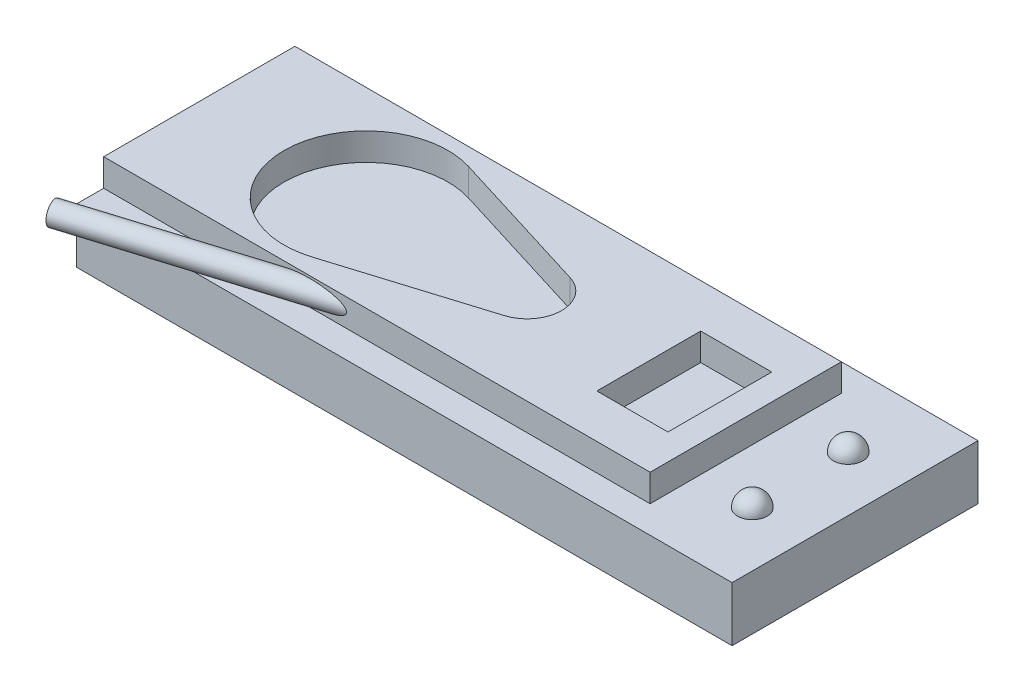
from build123d import *
from build123d.topology import SkipClean

# Parameters (mm, degrees)
SKETCH1_W           = 120
SKETCH1_H           = 45
BOSS_EXTRUDE1_DEPTH = 10
SKETCH2_W           = 100
SKETCH2_H           = 35
BOSS_EXTRUDE2_DEPTH = 5
CUT_EXTRUDE1_DEPTH  = 5
SKETCH4_W           = 13
SKETCH4_H           = 19
CUT_EXTRUDE2_DEPTH  = 5
SKETCH6_R           = 2
BOSS_EXTRUDE3_DEPTH = 64


with BuildPart() as part:
    # Sketch1 → Boss-Extrude1 (new body)
    with BuildSketch(Plane(origin=(0, 0, 0), x_dir=(1, 0, 0), z_dir=(0, 1, 0))):
        Rectangle(SKETCH1_W, SKETCH1_H)
    extrude(amount=BOSS_EXTRUDE1_DEPTH)

    # Sketch2 → Boss-Extrude2 (add)
    with BuildSketch(Plane(origin=(0, 10, 0), x_dir=(1, 0, 0), z_dir=(0, 1, 0))):
        with Locations((-10, 0)):
            Rectangle(SKETCH2_W, SKETCH2_H)
    extrude(amount=BOSS_EXTRUDE2_DEPTH)

    # Sketch3 → Cut-Extrude1 (cut)
    with BuildSketch(Plane(origin=(0, 15, 0), x_dir=(1, 0, 0), z_dir=(0, 1, 0))):
        with BuildLine():
            Line((1.85853637, -6.013757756), (-25.054671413, -14.331215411))
            ThreePointArc((-25.054671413, -14.331215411), (-44.483696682, 0), (-25.054671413, 14.331215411))
            Line((-25.054671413, 14.331215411), (1.85853637, 6.013757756))
            ThreePointArc((1.85853637, 6.013757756), (6.294397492, 0), (1.85853637, -6.013757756))
        make_face()
    extrude(amount=-CUT_EXTRUDE1_DEPTH, mode=Mode.SUBTRACT)

    # Sketch4 → Cut-Extrude2 (cut)
    with BuildSketch(Plane(origin=(0, 15, 0), x_dir=(1, 0, 0), z_dir=(0, 1, 0))):
        with Locations((28.755633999, 0)):
            Rectangle(SKETCH4_W, SKETCH4_H)
    extrude(amount=-CUT_EXTRUDE2_DEPTH, mode=Mode.SUBTRACT)

    # Sketch5 → Revolve1 (revolve)
    with SkipClean():  # the faces are left unmerged after this step: merging them gives an invalid solid
        with BuildSketch(Plane(origin=(0, 10, 0), x_dir=(1, 0, 0), z_dir=(0, 1, 0))):
            with BuildLine():
                ThreePointArc((52.679357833, 8.772734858), (50.925557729, 11.30521155), (47.938041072, 10.554214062))
                Line((47.938041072, 10.554214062), (49.974017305, 8.772734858))
                Line((49.974017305, 8.772734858), (52.679357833, 8.772734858))
            make_face()
            with BuildLine():
                Line((49.974017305, 8.772734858), (47.938041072, 10.554214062))
                ThreePointArc((47.938041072, 10.554214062), (47.441540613, 9.724275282), (47.268676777, 8.772734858))
                Line((47.268676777, 8.772734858), (49.974017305, 8.772734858))
            make_face()
            with BuildLine():
                ThreePointArc((52.679357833, 8.772734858), (50.925557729, 11.30521155), (47.938041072, 10.554214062))
                Line((47.938041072, 10.554214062), (49.974017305, 8.772734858))
                Line((49.974017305, 8.772734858), (52.679357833, 8.772734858))
            make_face()
            with BuildLine():
                Line((49.974017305, 8.772734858), (47.938041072, 10.554214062))
                ThreePointArc((47.938041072, 10.554214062), (47.441540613, 9.724275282), (47.268676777, 8.772734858))
                Line((47.268676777, 8.772734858), (49.974017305, 8.772734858))
            make_face()
        revolve1 = revolve(axis=Axis((47.268676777, 10, -8.772734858), (1, 0, 0)))

    # Mirror1: Revolve1 across plane
    with SkipClean():  # the faces are left unmerged after this step: merging them gives an invalid solid
        add(revolve1.mirror(Plane.XY))

    # Sketch6 → Boss-Extrude3 (add)
    with SkipClean():  # the faces are left unmerged after this step: merging them gives an invalid solid
        with BuildSketch(Plane(origin=(0, 0, 0), x_dir=(0, 1, 0), z_dir=(-0.9554143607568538, 0, 0.29526835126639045))):
            with Locations(Location((12.577810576, -10.127159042, 0), (0, 0, 270))):
                Circle(SKETCH6_R)
        extrude(amount=BOSS_EXTRUDE3_DEPTH)


solid = part.part
